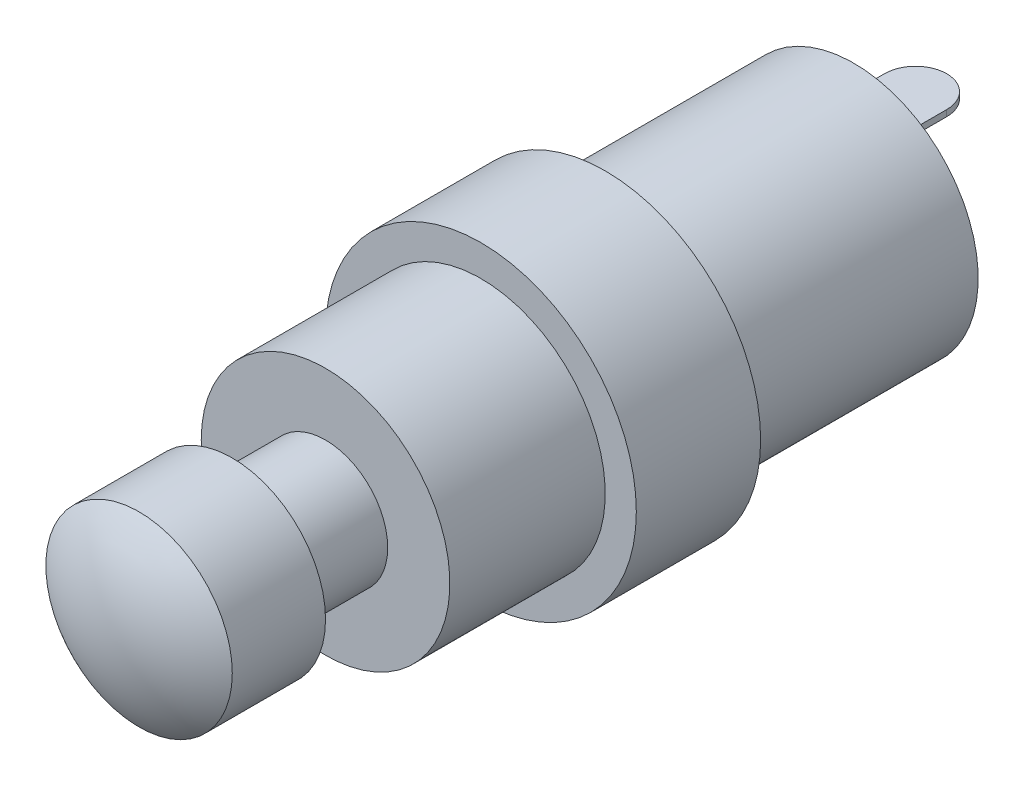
from build123d import *

# Parameters (mm, degrees)
ESQUISSE1_R       = 3
EXTRUSION1_DEPTH  = 3
D_ME1_FACE_RADIUS = 3
D_ME1_HEIGHT      = 1
ESQUISSE2_R       = 2
EXTRUSION2_DEPTH  = 3
ESQUISSE3_R       = 4
EXTRUSION3_DEPTH  = 5
ESQUISSE4_R       = 5
EXTRUSION4_DEPTH  = 4
ESQUISSE5_R       = 4
EXTRUSION5_DEPTH  = 8
EXTRUSION7_DEPTH  = 0.2
EXTRUSION8_DEPTH  = 0.2


with BuildPart() as part:
    # Esquisse1 → Extrusion1 (new body)
    with BuildSketch(Plane.XY):
        Circle(ESQUISSE1_R)
    extrude(amount=EXTRUSION1_DEPTH)

    # D_me1: a dome of height H over a round flat face of radius A is a cap of a sphere of radius (A * A + H * H) / (2 * H)
    d_me1_r = (D_ME1_FACE_RADIUS * D_ME1_FACE_RADIUS + D_ME1_HEIGHT * D_ME1_HEIGHT) / (2 * D_ME1_HEIGHT)
    d_me1_base = Plane((0, 0, 3), z_dir=(0, 0, 1))
    with Locations(d_me1_base.offset(D_ME1_HEIGHT - d_me1_r)):
        d_me1_ball = Sphere(d_me1_r, mode=Mode.PRIVATE)
    add(split(d_me1_ball, bisect_by=d_me1_base, keep=Keep.TOP, mode=Mode.PRIVATE))

    # Esquisse2 → Extrusion2 (add)
    with BuildSketch(Plane(origin=(0, 0, 0), x_dir=(-1, 0, 0), z_dir=(0, 0, -1))):
        with Locations(Location((0, 0, 0), (0, 0, 180))):
            Circle(ESQUISSE2_R)
    extrude(amount=EXTRUSION2_DEPTH)

    # Esquisse3 → Extrusion3 (add)
    with BuildSketch(Plane(origin=(0, 0, -3), x_dir=(-1, 0, 0), z_dir=(0, 0, -1))):
        Circle(ESQUISSE3_R)
    extrude(amount=EXTRUSION3_DEPTH)

    # Esquisse4 → Extrusion4 (add)
    with BuildSketch(Plane(origin=(0, 0, -8), x_dir=(-1, 0, 0), z_dir=(0, 0, -1))):
        Circle(ESQUISSE4_R)
    extrude(amount=EXTRUSION4_DEPTH)

    # Esquisse5 → Extrusion5 (add)
    with BuildSketch(Plane(origin=(0, 0, -12), x_dir=(-1, 0, 0), z_dir=(0, 0, -1))):
        Circle(ESQUISSE5_R)
    extrude(amount=EXTRUSION5_DEPTH)

    # Esquisse10 → Extrusion7 (add)
    with BuildSketch(Plane(origin=(0, -2, 0), x_dir=(-1, 0, 0), z_dir=(0, 1, 0))):
        with BuildLine():
            Line((1.013362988, -20), (-0.986637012, -20))
            Line((-0.986637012, -20), (-0.986637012, -22))
            ThreePointArc((-0.986637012, -22), (0.013362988, -23), (1.013362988, -22))
            Line((1.013362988, -22), (1.013362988, -20))
        make_face()
    extrude(amount=EXTRUSION7_DEPTH)

    # Esquisse11 → Extrusion8 (add)
    with BuildSketch(Plane(origin=(0, 2, 0), x_dir=(-1, 0, 0), z_dir=(0, 1, 0))):
        with BuildLine():
            Line((1.013362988, -20), (-0.986637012, -20))
            Line((-0.986637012, -20), (-0.986637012, -22))
            ThreePointArc((-0.986637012, -22), (0.013362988, -23), (1.013362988, -22))
            Line((1.013362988, -22), (1.013362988, -20))
        make_face()
    extrude(amount=EXTRUSION8_DEPTH)


solid = part.part
